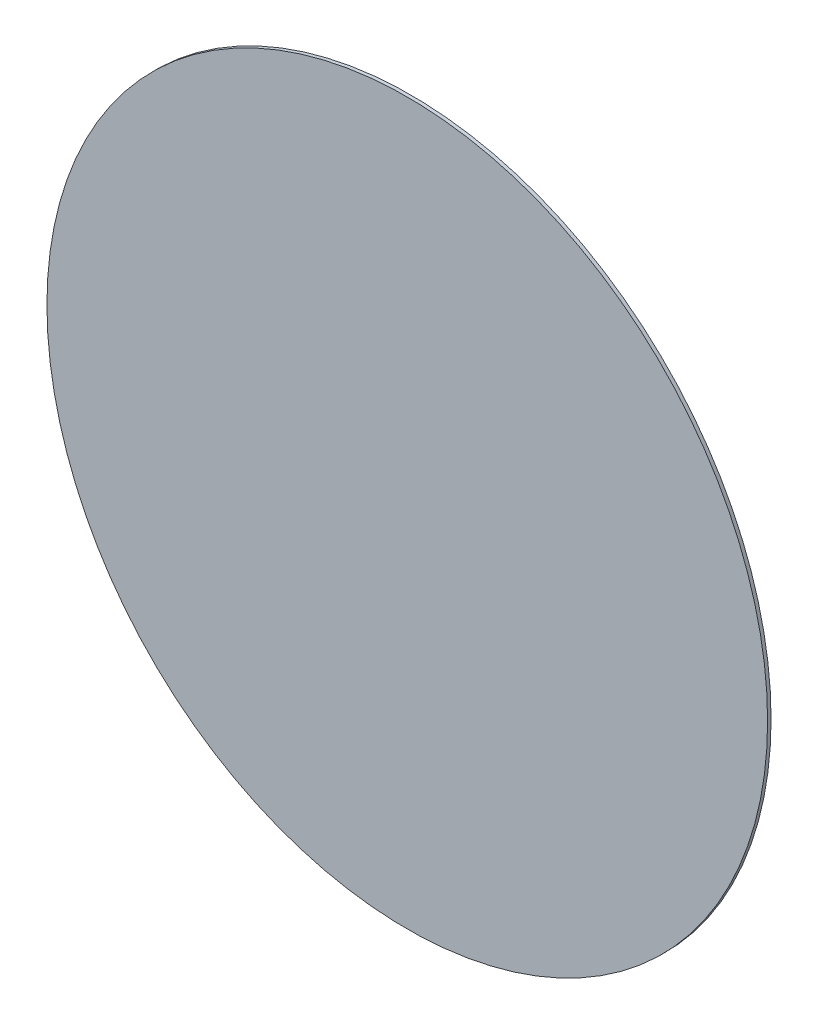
ISO-10303-21;
HEADER;
FILE_DESCRIPTION(('STEP AP214'),'2;1');
FILE_NAME('part.step','',(''),(''),'','','');
FILE_SCHEMA(('AUTOMOTIVE_DESIGN { 1 0 10303 214 1 1 1 1 }'));
ENDSEC;
DATA;
#1=APPLICATION_CONTEXT('core data for automotive mechanical design processes');
#2=APPLICATION_PROTOCOL_DEFINITION('international standard','automotive_design',2000,#1);
#3=PRODUCT_CONTEXT('',#1,'mechanical');
#4=PRODUCT('Part','Part','',(#3));
#5=PRODUCT_RELATED_PRODUCT_CATEGORY('part','',(#4));
#6=PRODUCT_DEFINITION_FORMATION('','',#4);
#7=PRODUCT_DEFINITION_CONTEXT('part definition',#1,'design');
#8=PRODUCT_DEFINITION('design','',#6,#7);
#9=PRODUCT_DEFINITION_SHAPE('','',#8);
#10=(LENGTH_UNIT() NAMED_UNIT(*) SI_UNIT(.MILLI.,.METRE.));
#11=(NAMED_UNIT(*) PLANE_ANGLE_UNIT() SI_UNIT($,.RADIAN.));
#12=(NAMED_UNIT(*) SI_UNIT($,.STERADIAN.) SOLID_ANGLE_UNIT());
#13=UNCERTAINTY_MEASURE_WITH_UNIT(LENGTH_MEASURE(1.E-05),#10,'distance_accuracy_value','');
#14=(GEOMETRIC_REPRESENTATION_CONTEXT(3) GLOBAL_UNCERTAINTY_ASSIGNED_CONTEXT((#13)) GLOBAL_UNIT_ASSIGNED_CONTEXT((#10,
#11,#12)) REPRESENTATION_CONTEXT('',''));
#15=CARTESIAN_POINT('',(0.,0.,0.));
#16=DIRECTION('',(0.,0.,1.));
#17=DIRECTION('',(1.,0.,0.));
#18=AXIS2_PLACEMENT_3D('',#15,#16,#17);
#19=CARTESIAN_POINT('',(0.,0.,0.12));
#20=DIRECTION('',(0.,0.,-1.));
#21=DIRECTION('',(-1.,0.,0.));
#22=AXIS2_PLACEMENT_3D('',#19,#20,#21);
#23=CYLINDRICAL_SURFACE('',#22,12.5);
#24=CARTESIAN_POINT('',(0.,0.,0.12));
#25=DIRECTION('',(0.,0.,1.));
#26=DIRECTION('',(1.,0.,0.));
#27=AXIS2_PLACEMENT_3D('',#24,#25,#26);
#28=CIRCLE('',#27,12.5);
#29=CARTESIAN_POINT('',(12.5,0.,0.12));
#30=VERTEX_POINT('',#29);
#31=EDGE_CURVE('E10',#30,#30,#28,.T.);
#32=ORIENTED_EDGE('',*,*,#31,.F.);
#33=EDGE_LOOP('',(#32));
#34=FACE_BOUND('',#33,.T.);
#35=CARTESIAN_POINT('',(0.,0.,0.));
#36=DIRECTION('',(0.,0.,1.));
#37=DIRECTION('',(1.,0.,0.));
#38=AXIS2_PLACEMENT_3D('',#35,#36,#37);
#39=CIRCLE('',#38,12.5);
#40=CARTESIAN_POINT('',(12.5,0.,0.));
#41=VERTEX_POINT('',#40);
#42=EDGE_CURVE('E34',#41,#41,#39,.T.);
#43=ORIENTED_EDGE('',*,*,#42,.T.);
#44=EDGE_LOOP('',(#43));
#45=FACE_BOUND('',#44,.T.);
#46=ADVANCED_FACE('F28',(#34,#45),#23,.T.);
#47=CARTESIAN_POINT('',(0.,0.,0.12));
#48=DIRECTION('',(0.,0.,1.));
#49=DIRECTION('',(1.,0.,0.));
#50=AXIS2_PLACEMENT_3D('',#47,#48,#49);
#51=PLANE('',#50);
#52=ORIENTED_EDGE('',*,*,#31,.T.);
#53=EDGE_LOOP('',(#52));
#54=FACE_BOUND('',#53,.T.);
#55=ADVANCED_FACE('F43',(#54),#51,.T.);
#56=CARTESIAN_POINT('',(0.,0.,0.));
#57=DIRECTION('',(0.,0.,1.));
#58=DIRECTION('',(1.,0.,0.));
#59=AXIS2_PLACEMENT_3D('',#56,#57,#58);
#60=PLANE('',#59);
#61=ORIENTED_EDGE('',*,*,#42,.F.);
#62=EDGE_LOOP('',(#61));
#63=FACE_BOUND('',#62,.T.);
#64=ADVANCED_FACE('F41',(#63),#60,.F.);
#65=CLOSED_SHELL('',(#46,#55,#64));
#66=MANIFOLD_SOLID_BREP('B2',#65);
#67=ADVANCED_BREP_SHAPE_REPRESENTATION('',(#18,#66),#14);
#68=SHAPE_DEFINITION_REPRESENTATION(#9,#67);
ENDSEC;
END-ISO-10303-21;
